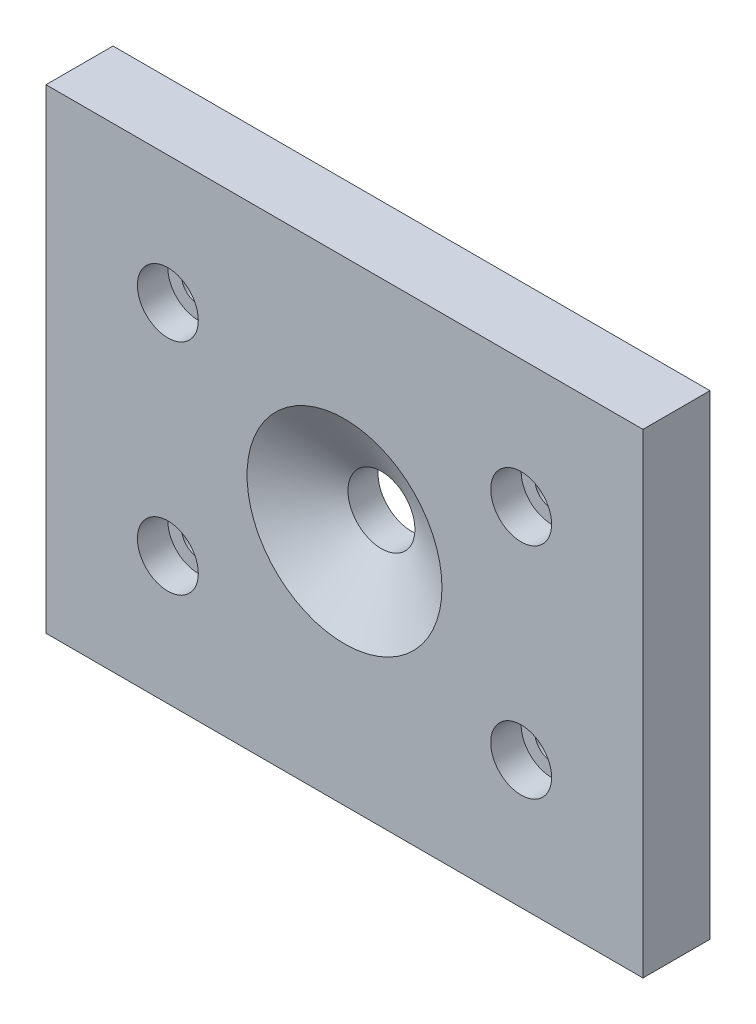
ISO-10303-21;
HEADER;
FILE_DESCRIPTION(('STEP AP214'),'2;1');
FILE_NAME('part.step','',(''),(''),'','','');
FILE_SCHEMA(('AUTOMOTIVE_DESIGN { 1 0 10303 214 1 1 1 1 }'));
ENDSEC;
DATA;
#1=APPLICATION_CONTEXT('core data for automotive mechanical design processes');
#2=APPLICATION_PROTOCOL_DEFINITION('international standard','automotive_design',2000,#1);
#3=PRODUCT_CONTEXT('',#1,'mechanical');
#4=PRODUCT('Part','Part','',(#3));
#5=PRODUCT_RELATED_PRODUCT_CATEGORY('part','',(#4));
#6=PRODUCT_DEFINITION_FORMATION('','',#4);
#7=PRODUCT_DEFINITION_CONTEXT('part definition',#1,'design');
#8=PRODUCT_DEFINITION('design','',#6,#7);
#9=PRODUCT_DEFINITION_SHAPE('','',#8);
#10=(LENGTH_UNIT() NAMED_UNIT(*) SI_UNIT(.MILLI.,.METRE.));
#11=(NAMED_UNIT(*) PLANE_ANGLE_UNIT() SI_UNIT($,.RADIAN.));
#12=(NAMED_UNIT(*) SI_UNIT($,.STERADIAN.) SOLID_ANGLE_UNIT());
#13=UNCERTAINTY_MEASURE_WITH_UNIT(LENGTH_MEASURE(1.E-05),#10,'distance_accuracy_value','');
#14=(GEOMETRIC_REPRESENTATION_CONTEXT(3) GLOBAL_UNCERTAINTY_ASSIGNED_CONTEXT((#13)) GLOBAL_UNIT_ASSIGNED_CONTEXT((#10,
#11,#12)) REPRESENTATION_CONTEXT('',''));
#15=CARTESIAN_POINT('',(0.,0.,0.));
#16=DIRECTION('',(0.,0.,1.));
#17=DIRECTION('',(1.,0.,0.));
#18=AXIS2_PLACEMENT_3D('',#15,#16,#17);
#19=CARTESIAN_POINT('',(-49.,39.,11.));
#20=DIRECTION('',(1.,0.,0.));
#21=DIRECTION('',(0.,1.,0.));
#22=AXIS2_PLACEMENT_3D('',#19,#20,#21);
#23=PLANE('',#22);
#24=DIRECTION('',(0.,-1.,0.));
#25=VECTOR('',#24,1.);
#26=CARTESIAN_POINT('',(-49.,39.,0.));
#27=LINE('',#26,#25);
#28=CARTESIAN_POINT('',(-49.,39.,0.));
#29=VERTEX_POINT('',#28);
#30=CARTESIAN_POINT('',(-49.,-39.,0.));
#31=VERTEX_POINT('',#30);
#32=EDGE_CURVE('E77',#29,#31,#27,.T.);
#33=ORIENTED_EDGE('',*,*,#32,.T.);
#34=DIRECTION('',(0.,0.,-1.));
#35=VECTOR('',#34,1.);
#36=CARTESIAN_POINT('',(-49.,-39.,11.));
#37=LINE('',#36,#35);
#38=CARTESIAN_POINT('',(-49.,-39.,11.));
#39=VERTEX_POINT('',#38);
#40=EDGE_CURVE('E11',#39,#31,#37,.T.);
#41=ORIENTED_EDGE('',*,*,#40,.F.);
#42=DIRECTION('',(0.,-1.,0.));
#43=VECTOR('',#42,1.);
#44=CARTESIAN_POINT('',(-49.,39.,11.));
#45=LINE('',#44,#43);
#46=CARTESIAN_POINT('',(-49.,39.,11.));
#47=VERTEX_POINT('',#46);
#48=EDGE_CURVE('E100',#47,#39,#45,.T.);
#49=ORIENTED_EDGE('',*,*,#48,.F.);
#50=DIRECTION('',(0.,0.,-1.));
#51=VECTOR('',#50,1.);
#52=CARTESIAN_POINT('',(-49.,39.,11.));
#53=LINE('',#52,#51);
#54=EDGE_CURVE('E89',#47,#29,#53,.T.);
#55=ORIENTED_EDGE('',*,*,#54,.T.);
#56=EDGE_LOOP('',(#33,#41,#49,#55));
#57=FACE_BOUND('',#56,.T.);
#58=ADVANCED_FACE('F32',(#57),#23,.F.);
#59=CARTESIAN_POINT('',(-49.,-39.,11.));
#60=DIRECTION('',(0.,1.,0.));
#61=DIRECTION('',(-1.,0.,0.));
#62=AXIS2_PLACEMENT_3D('',#59,#60,#61);
#63=PLANE('',#62);
#64=DIRECTION('',(1.,0.,0.));
#65=VECTOR('',#64,1.);
#66=CARTESIAN_POINT('',(-49.,-39.,0.));
#67=LINE('',#66,#65);
#68=CARTESIAN_POINT('',(49.,-39.,0.));
#69=VERTEX_POINT('',#68);
#70=EDGE_CURVE('E73',#31,#69,#67,.T.);
#71=ORIENTED_EDGE('',*,*,#70,.T.);
#72=DIRECTION('',(0.,0.,-1.));
#73=VECTOR('',#72,1.);
#74=CARTESIAN_POINT('',(49.,-39.,11.));
#75=LINE('',#74,#73);
#76=CARTESIAN_POINT('',(49.,-39.,11.));
#77=VERTEX_POINT('',#76);
#78=EDGE_CURVE('E40',#77,#69,#75,.T.);
#79=ORIENTED_EDGE('',*,*,#78,.F.);
#80=DIRECTION('',(1.,0.,0.));
#81=VECTOR('',#80,1.);
#82=CARTESIAN_POINT('',(-49.,-39.,11.));
#83=LINE('',#82,#81);
#84=EDGE_CURVE('E85',#39,#77,#83,.T.);
#85=ORIENTED_EDGE('',*,*,#84,.F.);
#86=ORIENTED_EDGE('',*,*,#40,.T.);
#87=EDGE_LOOP('',(#71,#79,#85,#86));
#88=FACE_BOUND('',#87,.T.);
#89=ADVANCED_FACE('F84',(#88),#63,.F.);
#90=CARTESIAN_POINT('',(49.,39.,11.));
#91=DIRECTION('',(-1.,0.,0.));
#92=DIRECTION('',(0.,-1.,0.));
#93=AXIS2_PLACEMENT_3D('',#90,#91,#92);
#94=PLANE('',#93);
#95=DIRECTION('',(0.,1.,0.));
#96=VECTOR('',#95,1.);
#97=CARTESIAN_POINT('',(49.,39.,0.));
#98=LINE('',#97,#96);
#99=CARTESIAN_POINT('',(49.,39.,0.));
#100=VERTEX_POINT('',#99);
#101=EDGE_CURVE('E78',#69,#100,#98,.T.);
#102=ORIENTED_EDGE('',*,*,#101,.T.);
#103=DIRECTION('',(0.,0.,-1.));
#104=VECTOR('',#103,1.);
#105=CARTESIAN_POINT('',(49.,39.,11.));
#106=LINE('',#105,#104);
#107=CARTESIAN_POINT('',(49.,39.,11.));
#108=VERTEX_POINT('',#107);
#109=EDGE_CURVE('E106',#108,#100,#106,.T.);
#110=ORIENTED_EDGE('',*,*,#109,.F.);
#111=DIRECTION('',(0.,1.,0.));
#112=VECTOR('',#111,1.);
#113=CARTESIAN_POINT('',(49.,39.,11.));
#114=LINE('',#113,#112);
#115=EDGE_CURVE('E52',#77,#108,#114,.T.);
#116=ORIENTED_EDGE('',*,*,#115,.F.);
#117=ORIENTED_EDGE('',*,*,#78,.T.);
#118=EDGE_LOOP('',(#102,#110,#116,#117));
#119=FACE_BOUND('',#118,.T.);
#120=ADVANCED_FACE('F110',(#119),#94,.F.);
#121=CARTESIAN_POINT('',(-49.,39.,11.));
#122=DIRECTION('',(0.,-1.,0.));
#123=DIRECTION('',(1.,0.,0.));
#124=AXIS2_PLACEMENT_3D('',#121,#122,#123);
#125=PLANE('',#124);
#126=DIRECTION('',(-1.,0.,0.));
#127=VECTOR('',#126,1.);
#128=CARTESIAN_POINT('',(-49.,39.,0.));
#129=LINE('',#128,#127);
#130=EDGE_CURVE('E98',#100,#29,#129,.T.);
#131=ORIENTED_EDGE('',*,*,#130,.T.);
#132=ORIENTED_EDGE('',*,*,#54,.F.);
#133=DIRECTION('',(-1.,0.,0.));
#134=VECTOR('',#133,1.);
#135=CARTESIAN_POINT('',(-49.,39.,11.));
#136=LINE('',#135,#134);
#137=EDGE_CURVE('E47',#108,#47,#136,.T.);
#138=ORIENTED_EDGE('',*,*,#137,.F.);
#139=ORIENTED_EDGE('',*,*,#109,.T.);
#140=EDGE_LOOP('',(#131,#132,#138,#139));
#141=FACE_BOUND('',#140,.T.);
#142=ADVANCED_FACE('F112',(#141),#125,.F.);
#143=CARTESIAN_POINT('',(-49.,-39.,11.));
#144=DIRECTION('',(0.,0.,1.));
#145=DIRECTION('',(1.,0.,0.));
#146=AXIS2_PLACEMENT_3D('',#143,#144,#145);
#147=PLANE('',#146);
#148=CARTESIAN_POINT('',(0.,0.,11.));
#149=DIRECTION('',(0.,0.,1.));
#150=DIRECTION('',(1.,0.,0.));
#151=AXIS2_PLACEMENT_3D('',#148,#149,#150);
#152=CIRCLE('',#151,16.);
#153=CARTESIAN_POINT('',(16.,0.,11.));
#154=VERTEX_POINT('',#153);
#155=EDGE_CURVE('E296',#154,#154,#152,.T.);
#156=ORIENTED_EDGE('',*,*,#155,.F.);
#157=EDGE_LOOP('',(#156));
#158=FACE_BOUND('',#157,.T.);
#159=CARTESIAN_POINT('',(-29.,18.,11.));
#160=DIRECTION('',(0.,0.,1.));
#161=DIRECTION('',(1.,0.,0.));
#162=AXIS2_PLACEMENT_3D('',#159,#160,#161);
#163=CIRCLE('',#162,4.99999999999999);
#164=CARTESIAN_POINT('',(-24.,18.,11.));
#165=VERTEX_POINT('',#164);
#166=EDGE_CURVE('E313',#165,#165,#163,.T.);
#167=ORIENTED_EDGE('',*,*,#166,.F.);
#168=EDGE_LOOP('',(#167));
#169=FACE_BOUND('',#168,.T.);
#170=CARTESIAN_POINT('',(29.,18.,11.));
#171=DIRECTION('',(0.,0.,1.));
#172=DIRECTION('',(1.,0.,0.));
#173=AXIS2_PLACEMENT_3D('',#170,#171,#172);
#174=CIRCLE('',#173,4.99999999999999);
#175=CARTESIAN_POINT('',(34.,18.,11.));
#176=VERTEX_POINT('',#175);
#177=EDGE_CURVE('E325',#176,#176,#174,.T.);
#178=ORIENTED_EDGE('',*,*,#177,.F.);
#179=EDGE_LOOP('',(#178));
#180=FACE_BOUND('',#179,.T.);
#181=CARTESIAN_POINT('',(29.,-18.,11.));
#182=DIRECTION('',(0.,0.,1.));
#183=DIRECTION('',(1.,0.,0.));
#184=AXIS2_PLACEMENT_3D('',#181,#182,#183);
#185=CIRCLE('',#184,4.99999999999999);
#186=CARTESIAN_POINT('',(34.,-18.,11.));
#187=VERTEX_POINT('',#186);
#188=EDGE_CURVE('E337',#187,#187,#185,.T.);
#189=ORIENTED_EDGE('',*,*,#188,.F.);
#190=EDGE_LOOP('',(#189));
#191=FACE_BOUND('',#190,.T.);
#192=CARTESIAN_POINT('',(-29.,-18.,11.));
#193=DIRECTION('',(0.,0.,1.));
#194=DIRECTION('',(1.,0.,0.));
#195=AXIS2_PLACEMENT_3D('',#192,#193,#194);
#196=CIRCLE('',#195,4.99999999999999);
#197=CARTESIAN_POINT('',(-24.,-18.,11.));
#198=VERTEX_POINT('',#197);
#199=EDGE_CURVE('E90',#198,#198,#196,.T.);
#200=ORIENTED_EDGE('',*,*,#199,.F.);
#201=EDGE_LOOP('',(#200));
#202=FACE_BOUND('',#201,.T.);
#203=ORIENTED_EDGE('',*,*,#48,.T.);
#204=ORIENTED_EDGE('',*,*,#84,.T.);
#205=ORIENTED_EDGE('',*,*,#115,.T.);
#206=ORIENTED_EDGE('',*,*,#137,.T.);
#207=EDGE_LOOP('',(#203,#204,#205,#206));
#208=FACE_BOUND('',#207,.T.);
#209=ADVANCED_FACE('F113',(#158,#169,#180,#191,#202,#208),#147,.T.);
#210=CARTESIAN_POINT('',(-49.,-39.,0.));
#211=DIRECTION('',(0.,0.,1.));
#212=DIRECTION('',(1.,0.,0.));
#213=AXIS2_PLACEMENT_3D('',#210,#211,#212);
#214=PLANE('',#213);
#215=CARTESIAN_POINT('',(0.,0.,0.));
#216=DIRECTION('',(0.,0.,1.));
#217=DIRECTION('',(1.,0.,0.));
#218=AXIS2_PLACEMENT_3D('',#215,#216,#217);
#219=CIRCLE('',#218,5.5);
#220=CARTESIAN_POINT('',(5.5,0.,0.));
#221=VERTEX_POINT('',#220);
#222=EDGE_CURVE('E299',#221,#221,#219,.T.);
#223=ORIENTED_EDGE('',*,*,#222,.T.);
#224=EDGE_LOOP('',(#223));
#225=FACE_BOUND('',#224,.T.);
#226=CARTESIAN_POINT('',(-29.,18.,0.));
#227=DIRECTION('',(0.,0.,1.));
#228=DIRECTION('',(1.,0.,0.));
#229=AXIS2_PLACEMENT_3D('',#226,#227,#228);
#230=CIRCLE('',#229,2.75);
#231=CARTESIAN_POINT('',(-26.25,18.,0.));
#232=VERTEX_POINT('',#231);
#233=EDGE_CURVE('E301',#232,#232,#230,.T.);
#234=ORIENTED_EDGE('',*,*,#233,.T.);
#235=EDGE_LOOP('',(#234));
#236=FACE_BOUND('',#235,.T.);
#237=CARTESIAN_POINT('',(29.,18.,0.));
#238=DIRECTION('',(0.,0.,1.));
#239=DIRECTION('',(1.,0.,0.));
#240=AXIS2_PLACEMENT_3D('',#237,#238,#239);
#241=CIRCLE('',#240,2.75);
#242=CARTESIAN_POINT('',(31.75,18.,0.));
#243=VERTEX_POINT('',#242);
#244=EDGE_CURVE('E316',#243,#243,#241,.T.);
#245=ORIENTED_EDGE('',*,*,#244,.T.);
#246=EDGE_LOOP('',(#245));
#247=FACE_BOUND('',#246,.T.);
#248=CARTESIAN_POINT('',(29.,-18.,0.));
#249=DIRECTION('',(0.,0.,1.));
#250=DIRECTION('',(1.,0.,0.));
#251=AXIS2_PLACEMENT_3D('',#248,#249,#250);
#252=CIRCLE('',#251,2.75);
#253=CARTESIAN_POINT('',(31.75,-18.,0.));
#254=VERTEX_POINT('',#253);
#255=EDGE_CURVE('E328',#254,#254,#252,.T.);
#256=ORIENTED_EDGE('',*,*,#255,.T.);
#257=EDGE_LOOP('',(#256));
#258=FACE_BOUND('',#257,.T.);
#259=CARTESIAN_POINT('',(-29.,-18.,0.));
#260=DIRECTION('',(0.,0.,1.));
#261=DIRECTION('',(1.,0.,0.));
#262=AXIS2_PLACEMENT_3D('',#259,#260,#261);
#263=CIRCLE('',#262,2.75);
#264=CARTESIAN_POINT('',(-26.25,-18.,0.));
#265=VERTEX_POINT('',#264);
#266=EDGE_CURVE('E340',#265,#265,#263,.T.);
#267=ORIENTED_EDGE('',*,*,#266,.T.);
#268=EDGE_LOOP('',(#267));
#269=FACE_BOUND('',#268,.T.);
#270=ORIENTED_EDGE('',*,*,#32,.F.);
#271=ORIENTED_EDGE('',*,*,#130,.F.);
#272=ORIENTED_EDGE('',*,*,#101,.F.);
#273=ORIENTED_EDGE('',*,*,#70,.F.);
#274=EDGE_LOOP('',(#270,#271,#272,#273));
#275=FACE_BOUND('',#274,.T.);
#276=ADVANCED_FACE('F74',(#225,#236,#247,#258,#269,#275),#214,.F.);
#277=CARTESIAN_POINT('',(-29.,-18.,11.));
#278=DIRECTION('',(0.,0.,1.));
#279=DIRECTION('',(1.,0.,0.));
#280=AXIS2_PLACEMENT_3D('',#277,#278,#279);
#281=CYLINDRICAL_SURFACE('',#280,5.);
#282=CARTESIAN_POINT('',(-29.,-18.,6.));
#283=DIRECTION('',(0.,0.,1.));
#284=DIRECTION('',(1.,0.,0.));
#285=AXIS2_PLACEMENT_3D('',#282,#283,#284);
#286=CIRCLE('',#285,5.);
#287=CARTESIAN_POINT('',(-24.,-18.,6.));
#288=VERTEX_POINT('',#287);
#289=EDGE_CURVE('E93',#288,#288,#286,.T.);
#290=ORIENTED_EDGE('',*,*,#289,.F.);
#291=EDGE_LOOP('',(#290));
#292=FACE_BOUND('',#291,.T.);
#293=ORIENTED_EDGE('',*,*,#199,.T.);
#294=EDGE_LOOP('',(#293));
#295=FACE_BOUND('',#294,.T.);
#296=ADVANCED_FACE('F121',(#292,#295),#281,.F.);
#297=CARTESIAN_POINT('',(-26.25,-18.,6.));
#298=DIRECTION('',(0.,0.,-1.));
#299=DIRECTION('',(-1.,0.,0.));
#300=AXIS2_PLACEMENT_3D('',#297,#298,#299);
#301=PLANE('',#300);
#302=CARTESIAN_POINT('',(-29.,-18.,6.));
#303=DIRECTION('',(0.,0.,1.));
#304=DIRECTION('',(1.,0.,0.));
#305=AXIS2_PLACEMENT_3D('',#302,#303,#304);
#306=CIRCLE('',#305,2.75);
#307=CARTESIAN_POINT('',(-26.25,-18.,6.));
#308=VERTEX_POINT('',#307);
#309=EDGE_CURVE('E343',#308,#308,#306,.T.);
#310=ORIENTED_EDGE('',*,*,#309,.F.);
#311=EDGE_LOOP('',(#310));
#312=FACE_BOUND('',#311,.T.);
#313=ORIENTED_EDGE('',*,*,#289,.T.);
#314=EDGE_LOOP('',(#313));
#315=FACE_BOUND('',#314,.T.);
#316=ADVANCED_FACE('F151',(#312,#315),#301,.F.);
#317=CARTESIAN_POINT('',(-29.,-18.,11.));
#318=DIRECTION('',(0.,0.,1.));
#319=DIRECTION('',(1.,0.,0.));
#320=AXIS2_PLACEMENT_3D('',#317,#318,#319);
#321=CYLINDRICAL_SURFACE('',#320,2.75);
#322=ORIENTED_EDGE('',*,*,#266,.F.);
#323=EDGE_LOOP('',(#322));
#324=FACE_BOUND('',#323,.T.);
#325=ORIENTED_EDGE('',*,*,#309,.T.);
#326=EDGE_LOOP('',(#325));
#327=FACE_BOUND('',#326,.T.);
#328=ADVANCED_FACE('F162',(#324,#327),#321,.F.);
#329=CARTESIAN_POINT('',(29.,-18.,11.));
#330=DIRECTION('',(0.,0.,1.));
#331=DIRECTION('',(1.,0.,0.));
#332=AXIS2_PLACEMENT_3D('',#329,#330,#331);
#333=CYLINDRICAL_SURFACE('',#332,4.99999999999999);
#334=CARTESIAN_POINT('',(29.,-18.,6.));
#335=DIRECTION('',(0.,0.,1.));
#336=DIRECTION('',(1.,0.,0.));
#337=AXIS2_PLACEMENT_3D('',#334,#335,#336);
#338=CIRCLE('',#337,4.99999999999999);
#339=CARTESIAN_POINT('',(34.,-18.,6.));
#340=VERTEX_POINT('',#339);
#341=EDGE_CURVE('E334',#340,#340,#338,.T.);
#342=ORIENTED_EDGE('',*,*,#341,.F.);
#343=EDGE_LOOP('',(#342));
#344=FACE_BOUND('',#343,.T.);
#345=ORIENTED_EDGE('',*,*,#188,.T.);
#346=EDGE_LOOP('',(#345));
#347=FACE_BOUND('',#346,.T.);
#348=ADVANCED_FACE('F172',(#344,#347),#333,.F.);
#349=CARTESIAN_POINT('',(31.75,-18.,6.));
#350=DIRECTION('',(0.,0.,-1.));
#351=DIRECTION('',(-1.,0.,0.));
#352=AXIS2_PLACEMENT_3D('',#349,#350,#351);
#353=PLANE('',#352);
#354=CARTESIAN_POINT('',(29.,-18.,6.));
#355=DIRECTION('',(0.,0.,1.));
#356=DIRECTION('',(1.,0.,0.));
#357=AXIS2_PLACEMENT_3D('',#354,#355,#356);
#358=CIRCLE('',#357,2.75);
#359=CARTESIAN_POINT('',(31.75,-18.,6.));
#360=VERTEX_POINT('',#359);
#361=EDGE_CURVE('E331',#360,#360,#358,.T.);
#362=ORIENTED_EDGE('',*,*,#361,.F.);
#363=EDGE_LOOP('',(#362));
#364=FACE_BOUND('',#363,.T.);
#365=ORIENTED_EDGE('',*,*,#341,.T.);
#366=EDGE_LOOP('',(#365));
#367=FACE_BOUND('',#366,.T.);
#368=ADVANCED_FACE('F182',(#364,#367),#353,.F.);
#369=CARTESIAN_POINT('',(29.,-18.,11.));
#370=DIRECTION('',(0.,0.,1.));
#371=DIRECTION('',(1.,0.,0.));
#372=AXIS2_PLACEMENT_3D('',#369,#370,#371);
#373=CYLINDRICAL_SURFACE('',#372,2.75);
#374=ORIENTED_EDGE('',*,*,#255,.F.);
#375=EDGE_LOOP('',(#374));
#376=FACE_BOUND('',#375,.T.);
#377=ORIENTED_EDGE('',*,*,#361,.T.);
#378=EDGE_LOOP('',(#377));
#379=FACE_BOUND('',#378,.T.);
#380=ADVANCED_FACE('F192',(#376,#379),#373,.F.);
#381=CARTESIAN_POINT('',(29.,18.,11.));
#382=DIRECTION('',(0.,0.,1.));
#383=DIRECTION('',(1.,0.,0.));
#384=AXIS2_PLACEMENT_3D('',#381,#382,#383);
#385=CYLINDRICAL_SURFACE('',#384,4.99999999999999);
#386=CARTESIAN_POINT('',(29.,18.,6.));
#387=DIRECTION('',(0.,0.,1.));
#388=DIRECTION('',(1.,0.,0.));
#389=AXIS2_PLACEMENT_3D('',#386,#387,#388);
#390=CIRCLE('',#389,4.99999999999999);
#391=CARTESIAN_POINT('',(34.,18.,6.));
#392=VERTEX_POINT('',#391);
#393=EDGE_CURVE('E322',#392,#392,#390,.T.);
#394=ORIENTED_EDGE('',*,*,#393,.F.);
#395=EDGE_LOOP('',(#394));
#396=FACE_BOUND('',#395,.T.);
#397=ORIENTED_EDGE('',*,*,#177,.T.);
#398=EDGE_LOOP('',(#397));
#399=FACE_BOUND('',#398,.T.);
#400=ADVANCED_FACE('F202',(#396,#399),#385,.F.);
#401=CARTESIAN_POINT('',(31.75,18.,6.));
#402=DIRECTION('',(0.,0.,-1.));
#403=DIRECTION('',(-1.,0.,0.));
#404=AXIS2_PLACEMENT_3D('',#401,#402,#403);
#405=PLANE('',#404);
#406=CARTESIAN_POINT('',(29.,18.,6.));
#407=DIRECTION('',(0.,0.,1.));
#408=DIRECTION('',(1.,0.,0.));
#409=AXIS2_PLACEMENT_3D('',#406,#407,#408);
#410=CIRCLE('',#409,2.75);
#411=CARTESIAN_POINT('',(31.75,18.,6.));
#412=VERTEX_POINT('',#411);
#413=EDGE_CURVE('E319',#412,#412,#410,.T.);
#414=ORIENTED_EDGE('',*,*,#413,.F.);
#415=EDGE_LOOP('',(#414));
#416=FACE_BOUND('',#415,.T.);
#417=ORIENTED_EDGE('',*,*,#393,.T.);
#418=EDGE_LOOP('',(#417));
#419=FACE_BOUND('',#418,.T.);
#420=ADVANCED_FACE('F212',(#416,#419),#405,.F.);
#421=CARTESIAN_POINT('',(29.,18.,11.));
#422=DIRECTION('',(0.,0.,1.));
#423=DIRECTION('',(1.,0.,0.));
#424=AXIS2_PLACEMENT_3D('',#421,#422,#423);
#425=CYLINDRICAL_SURFACE('',#424,2.75);
#426=ORIENTED_EDGE('',*,*,#244,.F.);
#427=EDGE_LOOP('',(#426));
#428=FACE_BOUND('',#427,.T.);
#429=ORIENTED_EDGE('',*,*,#413,.T.);
#430=EDGE_LOOP('',(#429));
#431=FACE_BOUND('',#430,.T.);
#432=ADVANCED_FACE('F222',(#428,#431),#425,.F.);
#433=CARTESIAN_POINT('',(-29.,18.,11.));
#434=DIRECTION('',(0.,0.,1.));
#435=DIRECTION('',(1.,0.,0.));
#436=AXIS2_PLACEMENT_3D('',#433,#434,#435);
#437=CYLINDRICAL_SURFACE('',#436,5.);
#438=CARTESIAN_POINT('',(-29.,18.,6.));
#439=DIRECTION('',(0.,0.,1.));
#440=DIRECTION('',(1.,0.,0.));
#441=AXIS2_PLACEMENT_3D('',#438,#439,#440);
#442=CIRCLE('',#441,5.);
#443=CARTESIAN_POINT('',(-24.,18.,6.));
#444=VERTEX_POINT('',#443);
#445=EDGE_CURVE('E310',#444,#444,#442,.T.);
#446=ORIENTED_EDGE('',*,*,#445,.F.);
#447=EDGE_LOOP('',(#446));
#448=FACE_BOUND('',#447,.T.);
#449=ORIENTED_EDGE('',*,*,#166,.T.);
#450=EDGE_LOOP('',(#449));
#451=FACE_BOUND('',#450,.T.);
#452=ADVANCED_FACE('F232',(#448,#451),#437,.F.);
#453=CARTESIAN_POINT('',(-26.25,18.,6.));
#454=DIRECTION('',(0.,0.,-1.));
#455=DIRECTION('',(-1.,0.,0.));
#456=AXIS2_PLACEMENT_3D('',#453,#454,#455);
#457=PLANE('',#456);
#458=CARTESIAN_POINT('',(-29.,18.,6.));
#459=DIRECTION('',(0.,0.,1.));
#460=DIRECTION('',(1.,0.,0.));
#461=AXIS2_PLACEMENT_3D('',#458,#459,#460);
#462=CIRCLE('',#461,2.75);
#463=CARTESIAN_POINT('',(-26.25,18.,6.));
#464=VERTEX_POINT('',#463);
#465=EDGE_CURVE('E307',#464,#464,#462,.T.);
#466=ORIENTED_EDGE('',*,*,#465,.F.);
#467=EDGE_LOOP('',(#466));
#468=FACE_BOUND('',#467,.T.);
#469=ORIENTED_EDGE('',*,*,#445,.T.);
#470=EDGE_LOOP('',(#469));
#471=FACE_BOUND('',#470,.T.);
#472=ADVANCED_FACE('F242',(#468,#471),#457,.F.);
#473=CARTESIAN_POINT('',(-29.,18.,11.));
#474=DIRECTION('',(0.,0.,1.));
#475=DIRECTION('',(1.,0.,0.));
#476=AXIS2_PLACEMENT_3D('',#473,#474,#475);
#477=CYLINDRICAL_SURFACE('',#476,2.75);
#478=ORIENTED_EDGE('',*,*,#233,.F.);
#479=EDGE_LOOP('',(#478));
#480=FACE_BOUND('',#479,.T.);
#481=ORIENTED_EDGE('',*,*,#465,.T.);
#482=EDGE_LOOP('',(#481));
#483=FACE_BOUND('',#482,.T.);
#484=ADVANCED_FACE('F252',(#480,#483),#477,.F.);
#485=CARTESIAN_POINT('',(0.,0.,0.));
#486=DIRECTION('',(0.,0.,1.));
#487=DIRECTION('',(1.,0.,0.));
#488=AXIS2_PLACEMENT_3D('',#485,#486,#487);
#489=CYLINDRICAL_SURFACE('',#488,5.5);
#490=CARTESIAN_POINT('',(0.,0.,4.93782217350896));
#491=DIRECTION('',(0.,0.,1.));
#492=DIRECTION('',(1.,0.,0.));
#493=AXIS2_PLACEMENT_3D('',#490,#491,#492);
#494=CIRCLE('',#493,5.5);
#495=CARTESIAN_POINT('',(5.5,0.,4.93782217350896));
#496=VERTEX_POINT('',#495);
#497=EDGE_CURVE('E35',#496,#496,#494,.T.);
#498=ORIENTED_EDGE('',*,*,#497,.T.);
#499=EDGE_LOOP('',(#498));
#500=FACE_BOUND('',#499,.T.);
#501=ORIENTED_EDGE('',*,*,#222,.F.);
#502=EDGE_LOOP('',(#501));
#503=FACE_BOUND('',#502,.T.);
#504=ADVANCED_FACE('F262',(#500,#503),#489,.F.);
#505=CARTESIAN_POINT('',(0.,0.,11.));
#506=DIRECTION('',(0.,0.,1.));
#507=DIRECTION('',(1.,0.,0.));
#508=AXIS2_PLACEMENT_3D('',#505,#506,#507);
#509=CONICAL_SURFACE('',#508,16.,1.0471975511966);
#510=ORIENTED_EDGE('',*,*,#155,.T.);
#511=EDGE_LOOP('',(#510));
#512=FACE_BOUND('',#511,.T.);
#513=ORIENTED_EDGE('',*,*,#497,.F.);
#514=EDGE_LOOP('',(#513));
#515=FACE_BOUND('',#514,.T.);
#516=ADVANCED_FACE('F280',(#512,#515),#509,.F.);
#517=CLOSED_SHELL('',(#58,#89,#120,#142,#209,#276,#296,#316,#328,#348,#368,#380,#400,#420,#432,
#452,#472,#484,#504,#516));
#518=MANIFOLD_SOLID_BREP('B2',#517);
#519=ADVANCED_BREP_SHAPE_REPRESENTATION('',(#18,#518),#14);
#520=SHAPE_DEFINITION_REPRESENTATION(#9,#519);
ENDSEC;
END-ISO-10303-21;
